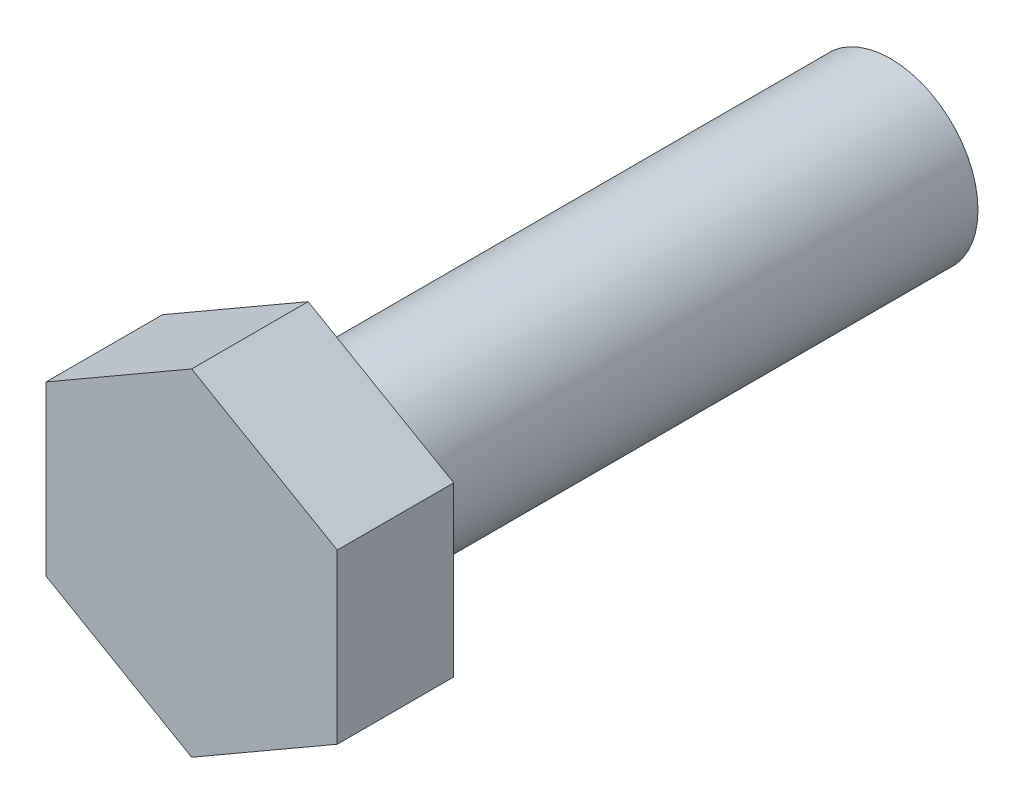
ISO-10303-21;
HEADER;
FILE_DESCRIPTION(('STEP AP214'),'2;1');
FILE_NAME('part.step','',(''),(''),'','','');
FILE_SCHEMA(('AUTOMOTIVE_DESIGN { 1 0 10303 214 1 1 1 1 }'));
ENDSEC;
DATA;
#1=APPLICATION_CONTEXT('core data for automotive mechanical design processes');
#2=APPLICATION_PROTOCOL_DEFINITION('international standard','automotive_design',2000,#1);
#3=PRODUCT_CONTEXT('',#1,'mechanical');
#4=PRODUCT('Part','Part','',(#3));
#5=PRODUCT_RELATED_PRODUCT_CATEGORY('part','',(#4));
#6=PRODUCT_DEFINITION_FORMATION('','',#4);
#7=PRODUCT_DEFINITION_CONTEXT('part definition',#1,'design');
#8=PRODUCT_DEFINITION('design','',#6,#7);
#9=PRODUCT_DEFINITION_SHAPE('','',#8);
#10=(LENGTH_UNIT() NAMED_UNIT(*) SI_UNIT(.MILLI.,.METRE.));
#11=(NAMED_UNIT(*) PLANE_ANGLE_UNIT() SI_UNIT($,.RADIAN.));
#12=(NAMED_UNIT(*) SI_UNIT($,.STERADIAN.) SOLID_ANGLE_UNIT());
#13=UNCERTAINTY_MEASURE_WITH_UNIT(LENGTH_MEASURE(1.E-05),#10,'distance_accuracy_value','');
#14=(GEOMETRIC_REPRESENTATION_CONTEXT(3) GLOBAL_UNCERTAINTY_ASSIGNED_CONTEXT((#13)) GLOBAL_UNIT_ASSIGNED_CONTEXT((#10,
#11,#12)) REPRESENTATION_CONTEXT('',''));
#15=CARTESIAN_POINT('',(0.,0.,0.));
#16=DIRECTION('',(0.,0.,1.));
#17=DIRECTION('',(1.,0.,0.));
#18=AXIS2_PLACEMENT_3D('',#15,#16,#17);
#19=CARTESIAN_POINT('',(0.,0.,10.));
#20=DIRECTION('',(0.,0.,1.));
#21=DIRECTION('',(-1.,0.,0.));
#22=AXIS2_PLACEMENT_3D('',#19,#20,#21);
#23=CYLINDRICAL_SURFACE('',#22,3.);
#24=CARTESIAN_POINT('',(0.,0.,0.));
#25=DIRECTION('',(0.,0.,-1.));
#26=DIRECTION('',(1.,0.,0.));
#27=AXIS2_PLACEMENT_3D('',#24,#25,#26);
#28=CIRCLE('',#27,3.);
#29=CARTESIAN_POINT('',(3.,0.,0.));
#30=VERTEX_POINT('',#29);
#31=EDGE_CURVE('E84',#30,#30,#28,.T.);
#32=ORIENTED_EDGE('',*,*,#31,.T.);
#33=EDGE_LOOP('',(#32));
#34=FACE_BOUND('',#33,.T.);
#35=CARTESIAN_POINT('',(0.,0.,-20.));
#36=DIRECTION('',(0.,0.,-1.));
#37=DIRECTION('',(1.,0.,0.));
#38=AXIS2_PLACEMENT_3D('',#35,#36,#37);
#39=CIRCLE('',#38,3.);
#40=CARTESIAN_POINT('',(3.,0.,-20.));
#41=VERTEX_POINT('',#40);
#42=EDGE_CURVE('E123',#41,#41,#39,.T.);
#43=ORIENTED_EDGE('',*,*,#42,.F.);
#44=EDGE_LOOP('',(#43));
#45=FACE_BOUND('',#44,.T.);
#46=ADVANCED_FACE('F14',(#34,#45),#23,.T.);
#47=CARTESIAN_POINT('',(0.,5.77350269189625,4.));
#48=DIRECTION('',(0.,0.,1.));
#49=DIRECTION('',(-1.,0.,0.));
#50=AXIS2_PLACEMENT_3D('',#47,#48,#49);
#51=PLANE('',#50);
#52=DIRECTION('',(0.866025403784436,0.5,0.));
#53=VECTOR('',#52,1.);
#54=CARTESIAN_POINT('',(-5.,2.88675134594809,4.));
#55=LINE('',#54,#53);
#56=CARTESIAN_POINT('',(-5.,2.88675134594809,4.));
#57=VERTEX_POINT('',#56);
#58=CARTESIAN_POINT('',(0.,5.77350269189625,4.));
#59=VERTEX_POINT('',#58);
#60=EDGE_CURVE('E67',#57,#59,#55,.T.);
#61=ORIENTED_EDGE('',*,*,#60,.F.);
#62=DIRECTION('',(0.,-1.,0.));
#63=VECTOR('',#62,1.);
#64=CARTESIAN_POINT('',(-5.,2.88675134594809,4.));
#65=LINE('',#64,#63);
#66=CARTESIAN_POINT('',(-5.,-2.88675134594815,4.));
#67=VERTEX_POINT('',#66);
#68=EDGE_CURVE('E73',#57,#67,#65,.T.);
#69=ORIENTED_EDGE('',*,*,#68,.T.);
#70=DIRECTION('',(0.86602540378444,-0.5,0.));
#71=VECTOR('',#70,1.);
#72=CARTESIAN_POINT('',(-5.,-2.88675134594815,4.));
#73=LINE('',#72,#71);
#74=CARTESIAN_POINT('',(0.,-5.77350269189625,4.));
#75=VERTEX_POINT('',#74);
#76=EDGE_CURVE('E95',#67,#75,#73,.T.);
#77=ORIENTED_EDGE('',*,*,#76,.T.);
#78=DIRECTION('',(-0.86602540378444,-0.5,0.));
#79=VECTOR('',#78,1.);
#80=CARTESIAN_POINT('',(5.,-2.88675134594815,4.));
#81=LINE('',#80,#79);
#82=CARTESIAN_POINT('',(5.,-2.88675134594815,4.));
#83=VERTEX_POINT('',#82);
#84=EDGE_CURVE('E98',#83,#75,#81,.T.);
#85=ORIENTED_EDGE('',*,*,#84,.F.);
#86=DIRECTION('',(0.,-1.,0.));
#87=VECTOR('',#86,1.);
#88=CARTESIAN_POINT('',(5.,2.88675134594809,4.));
#89=LINE('',#88,#87);
#90=CARTESIAN_POINT('',(5.,2.88675134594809,4.));
#91=VERTEX_POINT('',#90);
#92=EDGE_CURVE('E101',#91,#83,#89,.T.);
#93=ORIENTED_EDGE('',*,*,#92,.F.);
#94=DIRECTION('',(-0.866025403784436,0.5,0.));
#95=VECTOR('',#94,1.);
#96=CARTESIAN_POINT('',(5.,2.88675134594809,4.));
#97=LINE('',#96,#95);
#98=EDGE_CURVE('E104',#91,#59,#97,.T.);
#99=ORIENTED_EDGE('',*,*,#98,.T.);
#100=EDGE_LOOP('',(#61,#69,#77,#85,#93,#99));
#101=FACE_BOUND('',#100,.T.);
#102=ADVANCED_FACE('F130',(#101),#51,.T.);
#103=CARTESIAN_POINT('',(-5.,2.88675134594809,4.));
#104=DIRECTION('',(1.,0.,0.));
#105=DIRECTION('',(0.,1.,0.));
#106=AXIS2_PLACEMENT_3D('',#103,#104,#105);
#107=PLANE('',#106);
#108=DIRECTION('',(0.,0.,-1.));
#109=VECTOR('',#108,1.);
#110=CARTESIAN_POINT('',(-5.,-2.88675134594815,4.));
#111=LINE('',#110,#109);
#112=CARTESIAN_POINT('',(-5.,-2.88675134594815,0.));
#113=VERTEX_POINT('',#112);
#114=EDGE_CURVE('E21',#67,#113,#111,.T.);
#115=ORIENTED_EDGE('',*,*,#114,.F.);
#116=ORIENTED_EDGE('',*,*,#68,.F.);
#117=DIRECTION('',(0.,0.,-1.));
#118=VECTOR('',#117,1.);
#119=CARTESIAN_POINT('',(-5.,2.88675134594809,4.));
#120=LINE('',#119,#118);
#121=CARTESIAN_POINT('',(-5.,2.88675134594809,0.));
#122=VERTEX_POINT('',#121);
#123=EDGE_CURVE('E9',#57,#122,#120,.T.);
#124=ORIENTED_EDGE('',*,*,#123,.T.);
#125=DIRECTION('',(0.,-1.,0.));
#126=VECTOR('',#125,1.);
#127=CARTESIAN_POINT('',(-5.,2.88675134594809,0.));
#128=LINE('',#127,#126);
#129=EDGE_CURVE('E83',#122,#113,#128,.T.);
#130=ORIENTED_EDGE('',*,*,#129,.T.);
#131=EDGE_LOOP('',(#115,#116,#124,#130));
#132=FACE_BOUND('',#131,.T.);
#133=ADVANCED_FACE('F118',(#132),#107,.F.);
#134=CARTESIAN_POINT('',(-5.,-2.88675134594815,4.));
#135=DIRECTION('',(0.5,0.86602540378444,0.));
#136=DIRECTION('',(-0.86602540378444,0.5,0.));
#137=AXIS2_PLACEMENT_3D('',#134,#135,#136);
#138=PLANE('',#137);
#139=DIRECTION('',(0.,0.,-1.));
#140=VECTOR('',#139,1.);
#141=CARTESIAN_POINT('',(0.,-5.77350269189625,4.));
#142=LINE('',#141,#140);
#143=CARTESIAN_POINT('',(0.,-5.77350269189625,0.));
#144=VERTEX_POINT('',#143);
#145=EDGE_CURVE('E110',#75,#144,#142,.T.);
#146=ORIENTED_EDGE('',*,*,#145,.F.);
#147=ORIENTED_EDGE('',*,*,#76,.F.);
#148=ORIENTED_EDGE('',*,*,#114,.T.);
#149=DIRECTION('',(0.86602540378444,-0.5,0.));
#150=VECTOR('',#149,1.);
#151=CARTESIAN_POINT('',(-5.,-2.88675134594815,0.));
#152=LINE('',#151,#150);
#153=EDGE_CURVE('E114',#113,#144,#152,.T.);
#154=ORIENTED_EDGE('',*,*,#153,.T.);
#155=EDGE_LOOP('',(#146,#147,#148,#154));
#156=FACE_BOUND('',#155,.T.);
#157=ADVANCED_FACE('F113',(#156),#138,.F.);
#158=CARTESIAN_POINT('',(5.,-2.88675134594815,4.));
#159=DIRECTION('',(0.5,-0.86602540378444,0.));
#160=DIRECTION('',(0.86602540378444,0.5,0.));
#161=AXIS2_PLACEMENT_3D('',#158,#159,#160);
#162=PLANE('',#161);
#163=DIRECTION('',(0.,0.,-1.));
#164=VECTOR('',#163,1.);
#165=CARTESIAN_POINT('',(5.,-2.88675134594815,4.));
#166=LINE('',#165,#164);
#167=CARTESIAN_POINT('',(5.,-2.88675134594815,0.));
#168=VERTEX_POINT('',#167);
#169=EDGE_CURVE('E108',#83,#168,#166,.T.);
#170=ORIENTED_EDGE('',*,*,#169,.F.);
#171=ORIENTED_EDGE('',*,*,#84,.T.);
#172=ORIENTED_EDGE('',*,*,#145,.T.);
#173=DIRECTION('',(-0.86602540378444,-0.5,0.));
#174=VECTOR('',#173,1.);
#175=CARTESIAN_POINT('',(5.,-2.88675134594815,0.));
#176=LINE('',#175,#174);
#177=EDGE_CURVE('E89',#168,#144,#176,.T.);
#178=ORIENTED_EDGE('',*,*,#177,.F.);
#179=EDGE_LOOP('',(#170,#171,#172,#178));
#180=FACE_BOUND('',#179,.T.);
#181=ADVANCED_FACE('F154',(#180),#162,.T.);
#182=CARTESIAN_POINT('',(5.,2.88675134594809,4.));
#183=DIRECTION('',(1.,0.,0.));
#184=DIRECTION('',(0.,0.,1.));
#185=AXIS2_PLACEMENT_3D('',#182,#183,#184);
#186=PLANE('',#185);
#187=DIRECTION('',(0.,0.,-1.));
#188=VECTOR('',#187,1.);
#189=CARTESIAN_POINT('',(5.,2.88675134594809,4.));
#190=LINE('',#189,#188);
#191=CARTESIAN_POINT('',(5.,2.88675134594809,0.));
#192=VERTEX_POINT('',#191);
#193=EDGE_CURVE('E72',#91,#192,#190,.T.);
#194=ORIENTED_EDGE('',*,*,#193,.F.);
#195=ORIENTED_EDGE('',*,*,#92,.T.);
#196=ORIENTED_EDGE('',*,*,#169,.T.);
#197=DIRECTION('',(0.,-1.,0.));
#198=VECTOR('',#197,1.);
#199=CARTESIAN_POINT('',(5.,2.88675134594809,0.));
#200=LINE('',#199,#198);
#201=EDGE_CURVE('E87',#192,#168,#200,.T.);
#202=ORIENTED_EDGE('',*,*,#201,.F.);
#203=EDGE_LOOP('',(#194,#195,#196,#202));
#204=FACE_BOUND('',#203,.T.);
#205=ADVANCED_FACE('F151',(#204),#186,.T.);
#206=CARTESIAN_POINT('',(5.,2.88675134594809,4.));
#207=DIRECTION('',(-0.5,-0.866025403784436,0.));
#208=DIRECTION('',(0.866025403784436,-0.5,0.));
#209=AXIS2_PLACEMENT_3D('',#206,#207,#208);
#210=PLANE('',#209);
#211=ORIENTED_EDGE('',*,*,#98,.F.);
#212=ORIENTED_EDGE('',*,*,#193,.T.);
#213=DIRECTION('',(-0.866025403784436,0.5,0.));
#214=VECTOR('',#213,1.);
#215=CARTESIAN_POINT('',(5.,2.88675134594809,0.));
#216=LINE('',#215,#214);
#217=CARTESIAN_POINT('',(0.,5.77350269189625,0.));
#218=VERTEX_POINT('',#217);
#219=EDGE_CURVE('E80',#192,#218,#216,.T.);
#220=ORIENTED_EDGE('',*,*,#219,.T.);
#221=DIRECTION('',(0.,0.,-1.));
#222=VECTOR('',#221,1.);
#223=CARTESIAN_POINT('',(0.,5.77350269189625,4.));
#224=LINE('',#223,#222);
#225=EDGE_CURVE('E62',#59,#218,#224,.T.);
#226=ORIENTED_EDGE('',*,*,#225,.F.);
#227=EDGE_LOOP('',(#211,#212,#220,#226));
#228=FACE_BOUND('',#227,.T.);
#229=ADVANCED_FACE('F86',(#228),#210,.F.);
#230=CARTESIAN_POINT('',(-5.,2.88675134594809,4.));
#231=DIRECTION('',(-0.5,0.866025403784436,0.));
#232=DIRECTION('',(-0.866025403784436,-0.5,0.));
#233=AXIS2_PLACEMENT_3D('',#230,#231,#232);
#234=PLANE('',#233);
#235=ORIENTED_EDGE('',*,*,#123,.F.);
#236=ORIENTED_EDGE('',*,*,#60,.T.);
#237=ORIENTED_EDGE('',*,*,#225,.T.);
#238=DIRECTION('',(0.866025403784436,0.5,0.));
#239=VECTOR('',#238,1.);
#240=CARTESIAN_POINT('',(-5.,2.88675134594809,0.));
#241=LINE('',#240,#239);
#242=EDGE_CURVE('E65',#122,#218,#241,.T.);
#243=ORIENTED_EDGE('',*,*,#242,.F.);
#244=EDGE_LOOP('',(#235,#236,#237,#243));
#245=FACE_BOUND('',#244,.T.);
#246=ADVANCED_FACE('F64',(#245),#234,.T.);
#247=CARTESIAN_POINT('',(0.,5.77350269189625,0.));
#248=DIRECTION('',(0.,0.,1.));
#249=DIRECTION('',(-1.,0.,0.));
#250=AXIS2_PLACEMENT_3D('',#247,#248,#249);
#251=PLANE('',#250);
#252=ORIENTED_EDGE('',*,*,#242,.T.);
#253=ORIENTED_EDGE('',*,*,#219,.F.);
#254=ORIENTED_EDGE('',*,*,#201,.T.);
#255=ORIENTED_EDGE('',*,*,#177,.T.);
#256=ORIENTED_EDGE('',*,*,#153,.F.);
#257=ORIENTED_EDGE('',*,*,#129,.F.);
#258=EDGE_LOOP('',(#252,#253,#254,#255,#256,#257));
#259=FACE_BOUND('',#258,.T.);
#260=ORIENTED_EDGE('',*,*,#31,.F.);
#261=EDGE_LOOP('',(#260));
#262=FACE_BOUND('',#261,.T.);
#263=ADVANCED_FACE('F77',(#259,#262),#251,.F.);
#264=CARTESIAN_POINT('',(-2.25,0.,-20.));
#265=DIRECTION('',(0.,0.,-1.));
#266=DIRECTION('',(1.,0.,0.));
#267=AXIS2_PLACEMENT_3D('',#264,#265,#266);
#268=PLANE('',#267);
#269=ORIENTED_EDGE('',*,*,#42,.T.);
#270=EDGE_LOOP('',(#269));
#271=FACE_BOUND('',#270,.T.);
#272=ADVANCED_FACE('F127',(#271),#268,.T.);
#273=CLOSED_SHELL('',(#46,#102,#133,#157,#181,#205,#229,#246,#263,#272));
#274=MANIFOLD_SOLID_BREP('B1',#273);
#275=ADVANCED_BREP_SHAPE_REPRESENTATION('',(#18,#274),#14);
#276=SHAPE_DEFINITION_REPRESENTATION(#9,#275);
ENDSEC;
END-ISO-10303-21;
